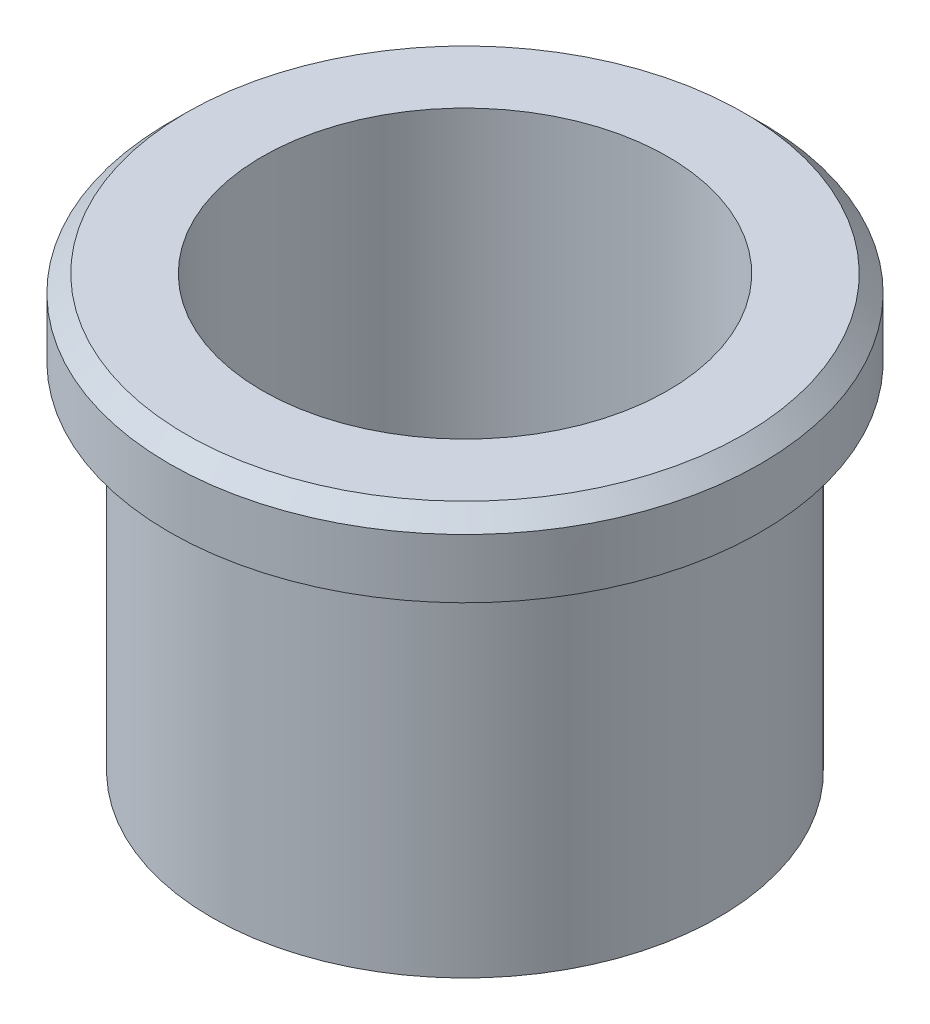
ISO-10303-21;
HEADER;
FILE_DESCRIPTION(('STEP AP214'),'2;1');
FILE_NAME('part.step','',(''),(''),'','','');
FILE_SCHEMA(('AUTOMOTIVE_DESIGN { 1 0 10303 214 1 1 1 1 }'));
ENDSEC;
DATA;
#1=APPLICATION_CONTEXT('core data for automotive mechanical design processes');
#2=APPLICATION_PROTOCOL_DEFINITION('international standard','automotive_design',2000,#1);
#3=PRODUCT_CONTEXT('',#1,'mechanical');
#4=PRODUCT('Part','Part','',(#3));
#5=PRODUCT_RELATED_PRODUCT_CATEGORY('part','',(#4));
#6=PRODUCT_DEFINITION_FORMATION('','',#4);
#7=PRODUCT_DEFINITION_CONTEXT('part definition',#1,'design');
#8=PRODUCT_DEFINITION('design','',#6,#7);
#9=PRODUCT_DEFINITION_SHAPE('','',#8);
#10=(LENGTH_UNIT() NAMED_UNIT(*) SI_UNIT(.MILLI.,.METRE.));
#11=(NAMED_UNIT(*) PLANE_ANGLE_UNIT() SI_UNIT($,.RADIAN.));
#12=(NAMED_UNIT(*) SI_UNIT($,.STERADIAN.) SOLID_ANGLE_UNIT());
#13=UNCERTAINTY_MEASURE_WITH_UNIT(LENGTH_MEASURE(1.E-05),#10,'distance_accuracy_value','');
#14=(GEOMETRIC_REPRESENTATION_CONTEXT(3) GLOBAL_UNCERTAINTY_ASSIGNED_CONTEXT((#13)) GLOBAL_UNIT_ASSIGNED_CONTEXT((#10,
#11,#12)) REPRESENTATION_CONTEXT('',''));
#15=CARTESIAN_POINT('',(0.,0.,0.));
#16=DIRECTION('',(0.,0.,1.));
#17=DIRECTION('',(1.,0.,0.));
#18=AXIS2_PLACEMENT_3D('',#15,#16,#17);
#19=CARTESIAN_POINT('',(0.,-0.999999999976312,0.));
#20=DIRECTION('',(0.,-1.,0.));
#21=DIRECTION('',(1.,0.,0.));
#22=AXIS2_PLACEMENT_3D('',#19,#20,#21);
#23=CONICAL_SURFACE('',#22,17.4999999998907,0.785398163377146);
#24=CARTESIAN_POINT('',(0.,-1.,0.));
#25=DIRECTION('',(0.,1.,0.));
#26=DIRECTION('',(0.,0.,1.));
#27=AXIS2_PLACEMENT_3D('',#24,#25,#26);
#28=CIRCLE('',#27,17.5);
#29=CARTESIAN_POINT('',(0.,-1.,17.5));
#30=VERTEX_POINT('',#29);
#31=EDGE_CURVE('E30',#30,#30,#28,.F.);
#32=ORIENTED_EDGE('',*,*,#31,.F.);
#33=EDGE_LOOP('',(#32));
#34=FACE_BOUND('',#33,.T.);
#35=CARTESIAN_POINT('',(0.,0.,0.));
#36=DIRECTION('',(0.,-1.,0.));
#37=DIRECTION('',(1.,0.,0.));
#38=AXIS2_PLACEMENT_3D('',#35,#36,#37);
#39=CIRCLE('',#38,16.499999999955);
#40=CARTESIAN_POINT('',(16.499999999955,0.,0.));
#41=VERTEX_POINT('',#40);
#42=EDGE_CURVE('E18',#41,#41,#39,.F.);
#43=ORIENTED_EDGE('',*,*,#42,.F.);
#44=EDGE_LOOP('',(#43));
#45=FACE_BOUND('',#44,.T.);
#46=ADVANCED_FACE('F14',(#34,#45),#23,.T.);
#47=CARTESIAN_POINT('',(0.,0.,12.));
#48=DIRECTION('',(0.,1.,0.));
#49=DIRECTION('',(0.,0.,1.));
#50=AXIS2_PLACEMENT_3D('',#47,#48,#49);
#51=PLANE('',#50);
#52=CARTESIAN_POINT('',(0.,0.,0.));
#53=DIRECTION('',(0.,1.,0.));
#54=DIRECTION('',(0.,0.,1.));
#55=AXIS2_PLACEMENT_3D('',#52,#53,#54);
#56=CIRCLE('',#55,12.);
#57=CARTESIAN_POINT('',(0.,0.,12.));
#58=VERTEX_POINT('',#57);
#59=EDGE_CURVE('E36',#58,#58,#56,.F.);
#60=ORIENTED_EDGE('',*,*,#59,.T.);
#61=EDGE_LOOP('',(#60));
#62=FACE_BOUND('',#61,.T.);
#63=ORIENTED_EDGE('',*,*,#42,.T.);
#64=EDGE_LOOP('',(#63));
#65=FACE_BOUND('',#64,.T.);
#66=ADVANCED_FACE('F46',(#62,#65),#51,.T.);
#67=CARTESIAN_POINT('',(0.,-12.75,0.));
#68=DIRECTION('',(0.,1.,0.));
#69=DIRECTION('',(0.,0.,1.));
#70=AXIS2_PLACEMENT_3D('',#67,#68,#69);
#71=CYLINDRICAL_SURFACE('',#70,17.5);
#72=CARTESIAN_POINT('',(0.,-4.5,0.));
#73=DIRECTION('',(0.,1.,0.));
#74=DIRECTION('',(0.,0.,1.));
#75=AXIS2_PLACEMENT_3D('',#72,#73,#74);
#76=CIRCLE('',#75,17.5);
#77=CARTESIAN_POINT('',(0.,-4.5,17.5));
#78=VERTEX_POINT('',#77);
#79=EDGE_CURVE('E34',#78,#78,#76,.T.);
#80=ORIENTED_EDGE('',*,*,#79,.T.);
#81=EDGE_LOOP('',(#80));
#82=FACE_BOUND('',#81,.T.);
#83=ORIENTED_EDGE('',*,*,#31,.T.);
#84=EDGE_LOOP('',(#83));
#85=FACE_BOUND('',#84,.T.);
#86=ADVANCED_FACE('F55',(#82,#85),#71,.T.);
#87=CARTESIAN_POINT('',(0.,-12.75,0.));
#88=DIRECTION('',(0.,1.,0.));
#89=DIRECTION('',(0.,0.,1.));
#90=AXIS2_PLACEMENT_3D('',#87,#88,#89);
#91=CYLINDRICAL_SURFACE('',#90,12.);
#92=ORIENTED_EDGE('',*,*,#59,.F.);
#93=EDGE_LOOP('',(#92));
#94=FACE_BOUND('',#93,.T.);
#95=CARTESIAN_POINT('',(0.,-25.5,0.));
#96=DIRECTION('',(0.,1.,0.));
#97=DIRECTION('',(0.,0.,1.));
#98=AXIS2_PLACEMENT_3D('',#95,#96,#97);
#99=CIRCLE('',#98,12.);
#100=CARTESIAN_POINT('',(0.,-25.5,12.));
#101=VERTEX_POINT('',#100);
#102=EDGE_CURVE('E27',#101,#101,#99,.F.);
#103=ORIENTED_EDGE('',*,*,#102,.T.);
#104=EDGE_LOOP('',(#103));
#105=FACE_BOUND('',#104,.T.);
#106=ADVANCED_FACE('F69',(#94,#105),#91,.F.);
#107=CARTESIAN_POINT('',(0.,-4.5,17.5));
#108=DIRECTION('',(0.,1.,0.));
#109=DIRECTION('',(0.,0.,1.));
#110=AXIS2_PLACEMENT_3D('',#107,#108,#109);
#111=PLANE('',#110);
#112=CARTESIAN_POINT('',(0.,-4.5,0.));
#113=DIRECTION('',(0.,1.,0.));
#114=DIRECTION('',(0.,0.,1.));
#115=AXIS2_PLACEMENT_3D('',#112,#113,#114);
#116=CIRCLE('',#115,15.);
#117=CARTESIAN_POINT('',(0.,-4.5,15.));
#118=VERTEX_POINT('',#117);
#119=EDGE_CURVE('E22',#118,#118,#116,.F.);
#120=ORIENTED_EDGE('',*,*,#119,.F.);
#121=EDGE_LOOP('',(#120));
#122=FACE_BOUND('',#121,.T.);
#123=ORIENTED_EDGE('',*,*,#79,.F.);
#124=EDGE_LOOP('',(#123));
#125=FACE_BOUND('',#124,.T.);
#126=ADVANCED_FACE('F62',(#122,#125),#111,.F.);
#127=CARTESIAN_POINT('',(0.,-25.5,15.));
#128=DIRECTION('',(0.,1.,0.));
#129=DIRECTION('',(0.,0.,1.));
#130=AXIS2_PLACEMENT_3D('',#127,#128,#129);
#131=PLANE('',#130);
#132=ORIENTED_EDGE('',*,*,#102,.F.);
#133=EDGE_LOOP('',(#132));
#134=FACE_BOUND('',#133,.T.);
#135=CARTESIAN_POINT('',(0.,-25.5,0.));
#136=DIRECTION('',(0.,1.,0.));
#137=DIRECTION('',(0.,0.,1.));
#138=AXIS2_PLACEMENT_3D('',#135,#136,#137);
#139=CIRCLE('',#138,15.);
#140=CARTESIAN_POINT('',(0.,-25.5,15.));
#141=VERTEX_POINT('',#140);
#142=EDGE_CURVE('E10',#141,#141,#139,.T.);
#143=ORIENTED_EDGE('',*,*,#142,.F.);
#144=EDGE_LOOP('',(#143));
#145=FACE_BOUND('',#144,.T.);
#146=ADVANCED_FACE('F58',(#134,#145),#131,.F.);
#147=CARTESIAN_POINT('',(0.,-12.75,0.));
#148=DIRECTION('',(0.,1.,0.));
#149=DIRECTION('',(0.,0.,1.));
#150=AXIS2_PLACEMENT_3D('',#147,#148,#149);
#151=CYLINDRICAL_SURFACE('',#150,15.);
#152=ORIENTED_EDGE('',*,*,#142,.T.);
#153=EDGE_LOOP('',(#152));
#154=FACE_BOUND('',#153,.T.);
#155=ORIENTED_EDGE('',*,*,#119,.T.);
#156=EDGE_LOOP('',(#155));
#157=FACE_BOUND('',#156,.T.);
#158=ADVANCED_FACE('F16',(#154,#157),#151,.T.);
#159=CLOSED_SHELL('',(#46,#66,#86,#106,#126,#146,#158));
#160=MANIFOLD_SOLID_BREP('B1',#159);
#161=ADVANCED_BREP_SHAPE_REPRESENTATION('',(#18,#160),#14);
#162=SHAPE_DEFINITION_REPRESENTATION(#9,#161);
ENDSEC;
END-ISO-10303-21;
